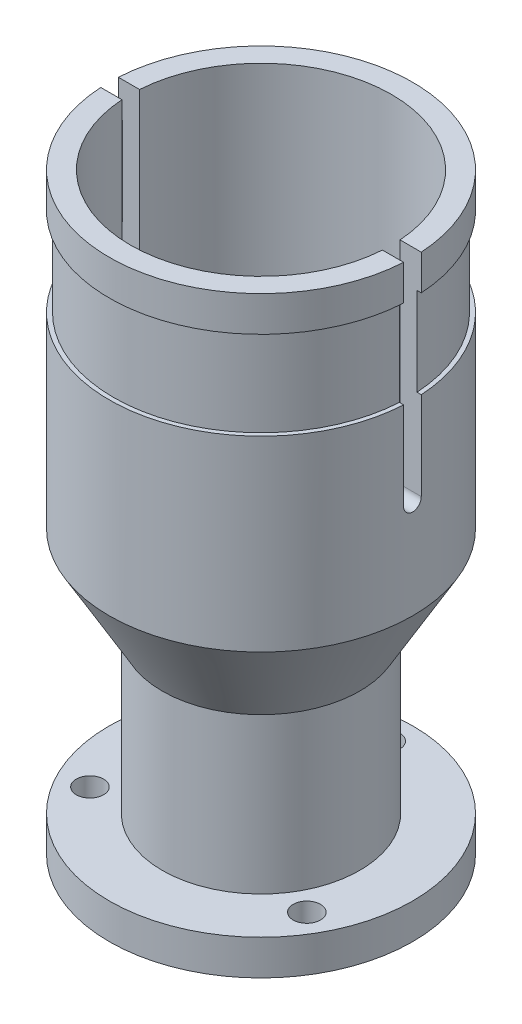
from build123d import *

# Parameters (mm, degrees)
CUT_EXTRUDE1_DEPTH               = 50.8
F_10_0_1935_DIAMETER_HOLE1_D     = 4.9149
F_10_0_1935_DIAMETER_HOLE1_DEPTH = 6.35
CIRPATTERN1_COUNT                = 3


with BuildPart() as part:
    # Sketch1 → Revolve1 (revolve)
    with BuildSketch(Plane.XY, mode=Mode.PRIVATE) as revolve1_sk:
        Polygon((-27.305, 106.68), (-27.305, 100.33), (-26.543, 100.33), (-26.543, 84.455), (-27.305, 84.455), (-27.305, 50.8), (-17.78, 34.302216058), (-17.78, 6.35), (-27.305, 6.35), (-27.305, 0), (-12.7, 0), (-12.7, 55.88), (-23.495, 55.88), (-23.495, 106.68), align=None)
    revolve(revolve1_sk.sketch.rotate(Axis((0, 0, 0), (0, 1, 0)), 270), axis=Axis((0, 0, 0), (0, 1, 0)))

    # Sketch2 → Cut-Extrude1 (cut, symmetric)
    with BuildSketch(Plane(origin=(0, 0, 0), x_dir=(0, 0, -1), z_dir=(1, 0, 0))):
        with BuildLine():
            Line((-1.5875, 68.58), (-1.5875, 130.362931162))
            ThreePointArc((-1.5875, 130.362931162), (0, 131.950431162), (1.5875, 130.362931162))
            Line((1.5875, 130.362931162), (1.5875, 68.58))
            ThreePointArc((1.5875, 68.58), (0, 66.9925), (-1.5875, 68.58))
        make_face()
    extrude(amount=CUT_EXTRUDE1_DEPTH, both=True, mode=Mode.SUBTRACT)

    # 10 _0.1935_ Diameter Hole1
    with Locations(Plane(origin=(0, 6.35, 0), x_dir=(1, 0, 0), z_dir=(0, 1, 0))):
        with Locations((0, 22.5425)):
            f_10_0_1935_diameter_hole1 = Hole(F_10_0_1935_DIAMETER_HOLE1_D / 2, depth=F_10_0_1935_DIAMETER_HOLE1_DEPTH)

    # CirPattern1: 10 _0.1935_ Diameter Hole1 ×3 about axis
    cirpattern1_axis = Axis((0, 0, 0), (0, 1, 0))
    for i in range(1, CIRPATTERN1_COUNT):
        add(f_10_0_1935_diameter_hole1.rotate(cirpattern1_axis, i * 360 / CIRPATTERN1_COUNT), mode=Mode.SUBTRACT)


solid = part.part
